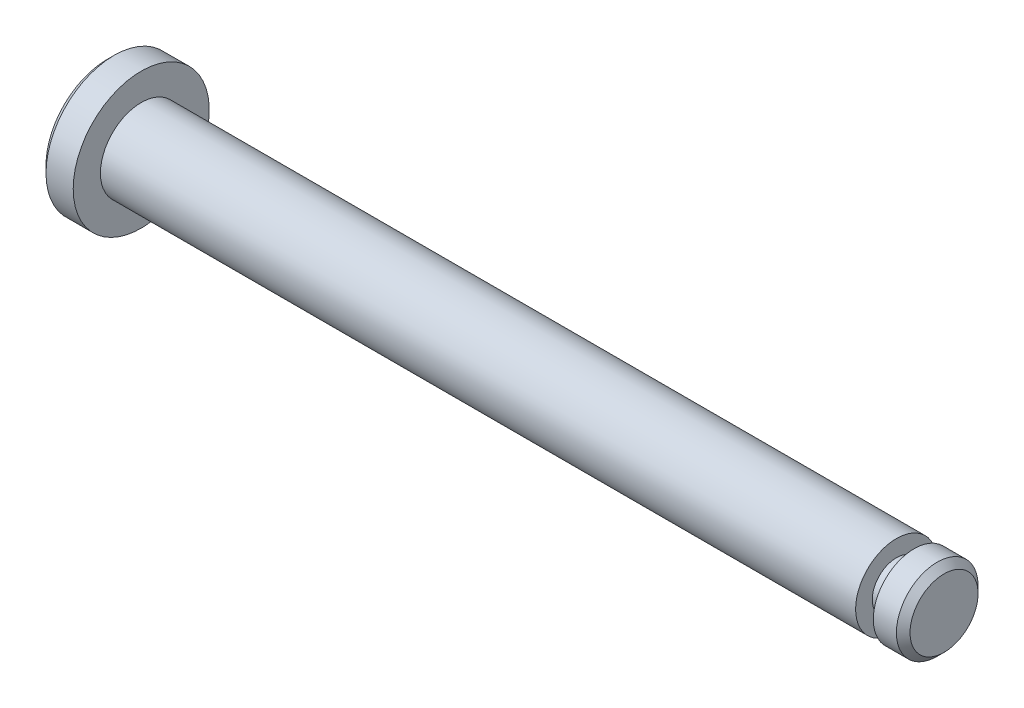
ISO-10303-21;
HEADER;
FILE_DESCRIPTION(('STEP AP214'),'2;1');
FILE_NAME('part.step','',(''),(''),'','','');
FILE_SCHEMA(('AUTOMOTIVE_DESIGN { 1 0 10303 214 1 1 1 1 }'));
ENDSEC;
DATA;
#1=APPLICATION_CONTEXT('core data for automotive mechanical design processes');
#2=APPLICATION_PROTOCOL_DEFINITION('international standard','automotive_design',2000,#1);
#3=PRODUCT_CONTEXT('',#1,'mechanical');
#4=PRODUCT('Part','Part','',(#3));
#5=PRODUCT_RELATED_PRODUCT_CATEGORY('part','',(#4));
#6=PRODUCT_DEFINITION_FORMATION('','',#4);
#7=PRODUCT_DEFINITION_CONTEXT('part definition',#1,'design');
#8=PRODUCT_DEFINITION('design','',#6,#7);
#9=PRODUCT_DEFINITION_SHAPE('','',#8);
#10=(LENGTH_UNIT() NAMED_UNIT(*) SI_UNIT(.MILLI.,.METRE.));
#11=(NAMED_UNIT(*) PLANE_ANGLE_UNIT() SI_UNIT($,.RADIAN.));
#12=(NAMED_UNIT(*) SI_UNIT($,.STERADIAN.) SOLID_ANGLE_UNIT());
#13=UNCERTAINTY_MEASURE_WITH_UNIT(LENGTH_MEASURE(1.E-05),#10,'distance_accuracy_value','');
#14=(GEOMETRIC_REPRESENTATION_CONTEXT(3) GLOBAL_UNCERTAINTY_ASSIGNED_CONTEXT((#13)) GLOBAL_UNIT_ASSIGNED_CONTEXT((#10,
#11,#12)) REPRESENTATION_CONTEXT('',''));
#15=CARTESIAN_POINT('',(0.,0.,0.));
#16=DIRECTION('',(0.,0.,1.));
#17=DIRECTION('',(1.,0.,0.));
#18=AXIS2_PLACEMENT_3D('',#15,#16,#17);
#19=CARTESIAN_POINT('',(-35.7171115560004,0.,0.));
#20=DIRECTION('',(1.,0.,0.));
#21=DIRECTION('',(0.,0.,-1.));
#22=AXIS2_PLACEMENT_3D('',#19,#20,#21);
#23=PLANE('',#22);
#24=CARTESIAN_POINT('',(-35.7171115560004,0.,0.));
#25=DIRECTION('',(1.,0.,0.));
#26=DIRECTION('',(0.,0.,-1.));
#27=AXIS2_PLACEMENT_3D('',#24,#25,#26);
#28=CIRCLE('',#27,8.99999999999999);
#29=CARTESIAN_POINT('',(-35.7171115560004,0.,-8.99999999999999));
#30=VERTEX_POINT('',#29);
#31=EDGE_CURVE('E35',#30,#30,#28,.F.);
#32=ORIENTED_EDGE('',*,*,#31,.T.);
#33=EDGE_LOOP('',(#32));
#34=FACE_BOUND('',#33,.T.);
#35=ADVANCED_FACE('F29',(#34),#23,.F.);
#36=CARTESIAN_POINT('',(-49.6368423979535,0.,0.));
#37=DIRECTION('',(-1.,0.,0.));
#38=DIRECTION('',(0.,0.,1.));
#39=AXIS2_PLACEMENT_3D('',#36,#37,#38);
#40=CYLINDRICAL_SURFACE('',#39,10.);
#41=CARTESIAN_POINT('',(-34.7171115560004,0.,0.));
#42=DIRECTION('',(1.,0.,0.));
#43=DIRECTION('',(0.,0.,-1.));
#44=AXIS2_PLACEMENT_3D('',#41,#42,#43);
#45=CIRCLE('',#44,10.);
#46=CARTESIAN_POINT('',(-34.7171115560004,0.,-10.));
#47=VERTEX_POINT('',#46);
#48=EDGE_CURVE('E10',#47,#47,#45,.T.);
#49=ORIENTED_EDGE('',*,*,#48,.T.);
#50=EDGE_LOOP('',(#49));
#51=FACE_BOUND('',#50,.T.);
#52=CARTESIAN_POINT('',(-30.7171115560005,0.,0.));
#53=DIRECTION('',(-1.,0.,0.));
#54=DIRECTION('',(0.,0.,1.));
#55=AXIS2_PLACEMENT_3D('',#52,#53,#54);
#56=CIRCLE('',#55,10.);
#57=CARTESIAN_POINT('',(-30.7171115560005,0.,10.));
#58=VERTEX_POINT('',#57);
#59=EDGE_CURVE('E48',#58,#58,#56,.T.);
#60=ORIENTED_EDGE('',*,*,#59,.T.);
#61=EDGE_LOOP('',(#60));
#62=FACE_BOUND('',#61,.T.);
#63=ADVANCED_FACE('F85',(#51,#62),#40,.T.);
#64=CARTESIAN_POINT('',(-30.7171115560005,10.,0.));
#65=DIRECTION('',(-1.,0.,0.));
#66=DIRECTION('',(0.,0.,1.));
#67=AXIS2_PLACEMENT_3D('',#64,#65,#66);
#68=PLANE('',#67);
#69=ORIENTED_EDGE('',*,*,#59,.F.);
#70=EDGE_LOOP('',(#69));
#71=FACE_BOUND('',#70,.T.);
#72=CARTESIAN_POINT('',(-30.7171115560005,0.,0.));
#73=DIRECTION('',(-1.,0.,0.));
#74=DIRECTION('',(0.,0.,1.));
#75=AXIS2_PLACEMENT_3D('',#72,#73,#74);
#76=CIRCLE('',#75,6.);
#77=CARTESIAN_POINT('',(-30.7171115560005,0.,6.));
#78=VERTEX_POINT('',#77);
#79=EDGE_CURVE('E51',#78,#78,#76,.T.);
#80=ORIENTED_EDGE('',*,*,#79,.T.);
#81=EDGE_LOOP('',(#80));
#82=FACE_BOUND('',#81,.T.);
#83=ADVANCED_FACE('F89',(#71,#82),#68,.F.);
#84=CARTESIAN_POINT('',(-49.6368423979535,0.,0.));
#85=DIRECTION('',(-1.,0.,0.));
#86=DIRECTION('',(0.,0.,1.));
#87=AXIS2_PLACEMENT_3D('',#84,#85,#86);
#88=CYLINDRICAL_SURFACE('',#87,6.);
#89=ORIENTED_EDGE('',*,*,#79,.F.);
#90=EDGE_LOOP('',(#89));
#91=FACE_BOUND('',#90,.T.);
#92=CARTESIAN_POINT('',(80.2828884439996,0.,0.));
#93=DIRECTION('',(-1.,0.,0.));
#94=DIRECTION('',(0.,0.,1.));
#95=AXIS2_PLACEMENT_3D('',#92,#93,#94);
#96=CIRCLE('',#95,6.);
#97=CARTESIAN_POINT('',(80.2828884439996,0.,6.));
#98=VERTEX_POINT('',#97);
#99=EDGE_CURVE('E54',#98,#98,#96,.T.);
#100=ORIENTED_EDGE('',*,*,#99,.T.);
#101=EDGE_LOOP('',(#100));
#102=FACE_BOUND('',#101,.T.);
#103=ADVANCED_FACE('F93',(#91,#102),#88,.T.);
#104=CARTESIAN_POINT('',(80.2828884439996,6.,0.));
#105=DIRECTION('',(-1.,0.,0.));
#106=DIRECTION('',(0.,0.,1.));
#107=AXIS2_PLACEMENT_3D('',#104,#105,#106);
#108=PLANE('',#107);
#109=ORIENTED_EDGE('',*,*,#99,.F.);
#110=EDGE_LOOP('',(#109));
#111=FACE_BOUND('',#110,.T.);
#112=CARTESIAN_POINT('',(80.2828884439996,0.,0.));
#113=DIRECTION('',(-1.,0.,0.));
#114=DIRECTION('',(0.,0.,1.));
#115=AXIS2_PLACEMENT_3D('',#112,#113,#114);
#116=CIRCLE('',#115,3.55257479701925);
#117=CARTESIAN_POINT('',(80.2828884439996,0.,3.55257479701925));
#118=VERTEX_POINT('',#117);
#119=EDGE_CURVE('E57',#118,#118,#116,.T.);
#120=ORIENTED_EDGE('',*,*,#119,.T.);
#121=EDGE_LOOP('',(#120));
#122=FACE_BOUND('',#121,.T.);
#123=ADVANCED_FACE('F100',(#111,#122),#108,.F.);
#124=CARTESIAN_POINT('',(-49.6368423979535,0.,0.));
#125=DIRECTION('',(-1.,0.,0.));
#126=DIRECTION('',(0.,0.,1.));
#127=AXIS2_PLACEMENT_3D('',#124,#125,#126);
#128=CYLINDRICAL_SURFACE('',#127,3.55257479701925);
#129=ORIENTED_EDGE('',*,*,#119,.F.);
#130=EDGE_LOOP('',(#129));
#131=FACE_BOUND('',#130,.T.);
#132=CARTESIAN_POINT('',(82.8832777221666,0.,0.));
#133=DIRECTION('',(-1.,0.,0.));
#134=DIRECTION('',(0.,0.,1.));
#135=AXIS2_PLACEMENT_3D('',#132,#133,#134);
#136=CIRCLE('',#135,3.55257479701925);
#137=CARTESIAN_POINT('',(82.8832777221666,0.,3.55257479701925));
#138=VERTEX_POINT('',#137);
#139=EDGE_CURVE('E60',#138,#138,#136,.T.);
#140=ORIENTED_EDGE('',*,*,#139,.T.);
#141=EDGE_LOOP('',(#140));
#142=FACE_BOUND('',#141,.T.);
#143=ADVANCED_FACE('F81',(#131,#142),#128,.T.);
#144=CARTESIAN_POINT('',(82.8832777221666,3.55257479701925,0.));
#145=DIRECTION('',(1.,0.,0.));
#146=DIRECTION('',(0.,0.,-1.));
#147=AXIS2_PLACEMENT_3D('',#144,#145,#146);
#148=PLANE('',#147);
#149=ORIENTED_EDGE('',*,*,#139,.F.);
#150=EDGE_LOOP('',(#149));
#151=FACE_BOUND('',#150,.T.);
#152=CARTESIAN_POINT('',(82.8832777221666,0.,0.));
#153=DIRECTION('',(-1.,0.,0.));
#154=DIRECTION('',(0.,0.,1.));
#155=AXIS2_PLACEMENT_3D('',#152,#153,#154);
#156=CIRCLE('',#155,6.00000000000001);
#157=CARTESIAN_POINT('',(82.8832777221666,0.,6.00000000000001));
#158=VERTEX_POINT('',#157);
#159=EDGE_CURVE('E63',#158,#158,#156,.T.);
#160=ORIENTED_EDGE('',*,*,#159,.T.);
#161=EDGE_LOOP('',(#160));
#162=FACE_BOUND('',#161,.T.);
#163=ADVANCED_FACE('F67',(#151,#162),#148,.F.);
#164=CARTESIAN_POINT('',(-49.6368423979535,0.,0.));
#165=DIRECTION('',(-1.,0.,0.));
#166=DIRECTION('',(0.,0.,1.));
#167=AXIS2_PLACEMENT_3D('',#164,#165,#166);
#168=CYLINDRICAL_SURFACE('',#167,6.00000000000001);
#169=CARTESIAN_POINT('',(86.2828884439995,0.,0.));
#170=DIRECTION('',(-1.,0.,0.));
#171=DIRECTION('',(0.,0.,1.));
#172=AXIS2_PLACEMENT_3D('',#169,#170,#171);
#173=CIRCLE('',#172,6.00000000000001);
#174=CARTESIAN_POINT('',(86.2828884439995,0.,6.00000000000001));
#175=VERTEX_POINT('',#174);
#176=EDGE_CURVE('E43',#175,#175,#173,.T.);
#177=ORIENTED_EDGE('',*,*,#176,.T.);
#178=EDGE_LOOP('',(#177));
#179=FACE_BOUND('',#178,.T.);
#180=ORIENTED_EDGE('',*,*,#159,.F.);
#181=EDGE_LOOP('',(#180));
#182=FACE_BOUND('',#181,.T.);
#183=ADVANCED_FACE('F69',(#179,#182),#168,.T.);
#184=CARTESIAN_POINT('',(87.2828884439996,6.00000000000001,0.));
#185=DIRECTION('',(-1.,0.,0.));
#186=DIRECTION('',(0.,0.,1.));
#187=AXIS2_PLACEMENT_3D('',#184,#185,#186);
#188=PLANE('',#187);
#189=CARTESIAN_POINT('',(87.2828884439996,0.,0.));
#190=DIRECTION('',(-1.,0.,0.));
#191=DIRECTION('',(0.,0.,1.));
#192=AXIS2_PLACEMENT_3D('',#189,#190,#191);
#193=CIRCLE('',#192,4.99999999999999);
#194=CARTESIAN_POINT('',(87.2828884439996,0.,4.99999999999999));
#195=VERTEX_POINT('',#194);
#196=EDGE_CURVE('E39',#195,#195,#193,.F.);
#197=ORIENTED_EDGE('',*,*,#196,.T.);
#198=EDGE_LOOP('',(#197));
#199=FACE_BOUND('',#198,.T.);
#200=ADVANCED_FACE('F71',(#199),#188,.F.);
#201=CARTESIAN_POINT('',(86.2828884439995,0.,0.));
#202=DIRECTION('',(-1.,0.,0.));
#203=DIRECTION('',(0.,0.,1.));
#204=AXIS2_PLACEMENT_3D('',#201,#202,#203);
#205=CONICAL_SURFACE('',#204,6.00000000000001,0.785398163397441);
#206=ORIENTED_EDGE('',*,*,#196,.F.);
#207=EDGE_LOOP('',(#206));
#208=FACE_BOUND('',#207,.T.);
#209=ORIENTED_EDGE('',*,*,#176,.F.);
#210=EDGE_LOOP('',(#209));
#211=FACE_BOUND('',#210,.T.);
#212=ADVANCED_FACE('F78',(#208,#211),#205,.T.);
#213=CARTESIAN_POINT('',(-35.7171115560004,0.,0.));
#214=DIRECTION('',(1.,0.,0.));
#215=DIRECTION('',(0.,0.,-1.));
#216=AXIS2_PLACEMENT_3D('',#213,#214,#215);
#217=CONICAL_SURFACE('',#216,8.99999999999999,0.785398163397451);
#218=ORIENTED_EDGE('',*,*,#48,.F.);
#219=EDGE_LOOP('',(#218));
#220=FACE_BOUND('',#219,.T.);
#221=ORIENTED_EDGE('',*,*,#31,.F.);
#222=EDGE_LOOP('',(#221));
#223=FACE_BOUND('',#222,.T.);
#224=ADVANCED_FACE('F137',(#220,#223),#217,.T.);
#225=CLOSED_SHELL('',(#35,#63,#83,#103,#123,#143,#163,#183,#200,#212,#224));
#226=MANIFOLD_SOLID_BREP('B2',#225);
#227=ADVANCED_BREP_SHAPE_REPRESENTATION('',(#18,#226),#14);
#228=SHAPE_DEFINITION_REPRESENTATION(#9,#227);
ENDSEC;
END-ISO-10303-21;
